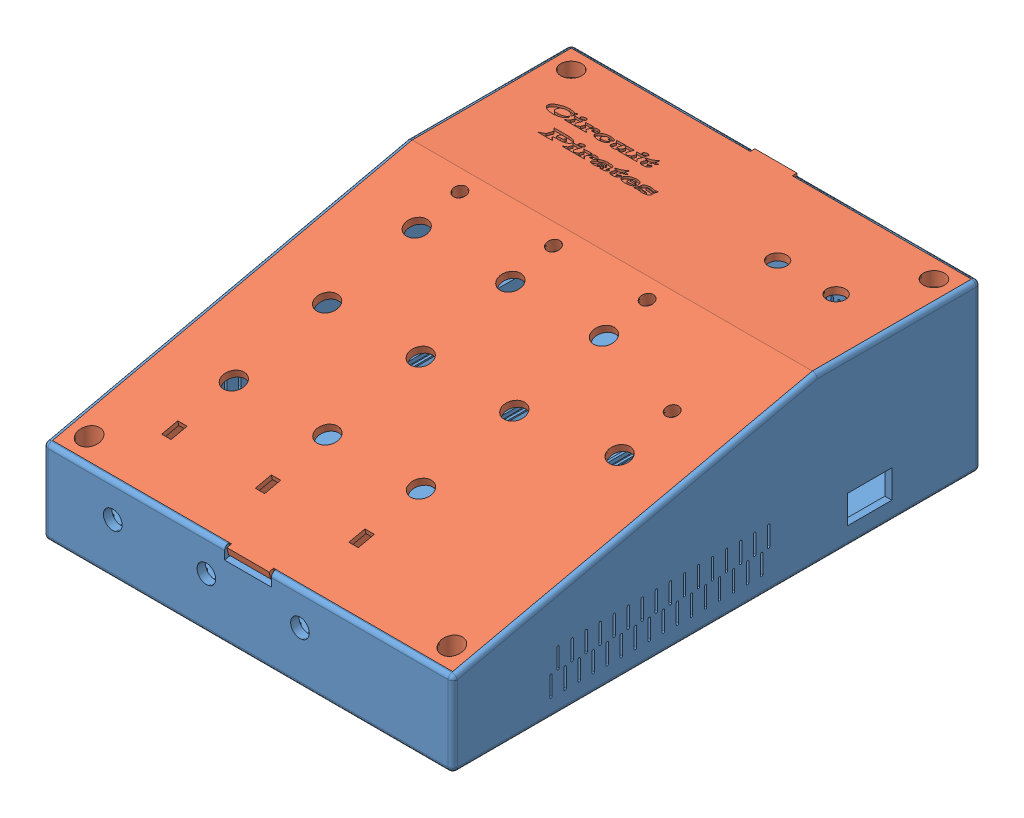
SolidWorks assembly Assem1.SLDASM, configuration Default (file format 13000). Lengths in mm.
Overall size (175 70.81 225.66).
2 component instances, 2 part files, 3 mates.
Components (placement in the parent):
- MainPartChanged-1: MainPartChanged.SLDPRT [Default] at origin size (175 70.81 225.66)
- LidChanged-1: LidChanged.SLDPRT [Default] at (-2 67.8142 2) size (171 44.81 225.62)
Mates (geometry in assembly coordinates):
- Coincident1: coincident anti-aligned: plane of MainPartChanged-1 through (0 67.8142 0) normal (0 1 0); plane of Lid-1 through (-173 67.8142 69.6685) normal (0 -1 0)
- Coincident2: coincident anti-aligned: plane of MainPartChanged-1 through (-173 67.8142 2) normal (0 0 1); plane of Lid-1 through (-173 67.8142 2) normal (0 0 -1)
- Coincident3: coincident anti-aligned: plane of MainPartChanged-1 through (-2 67.8142 70) normal (-1 0 0); plane of Lid-1 through (-2 67.8142 2) normal (1 0 0)
